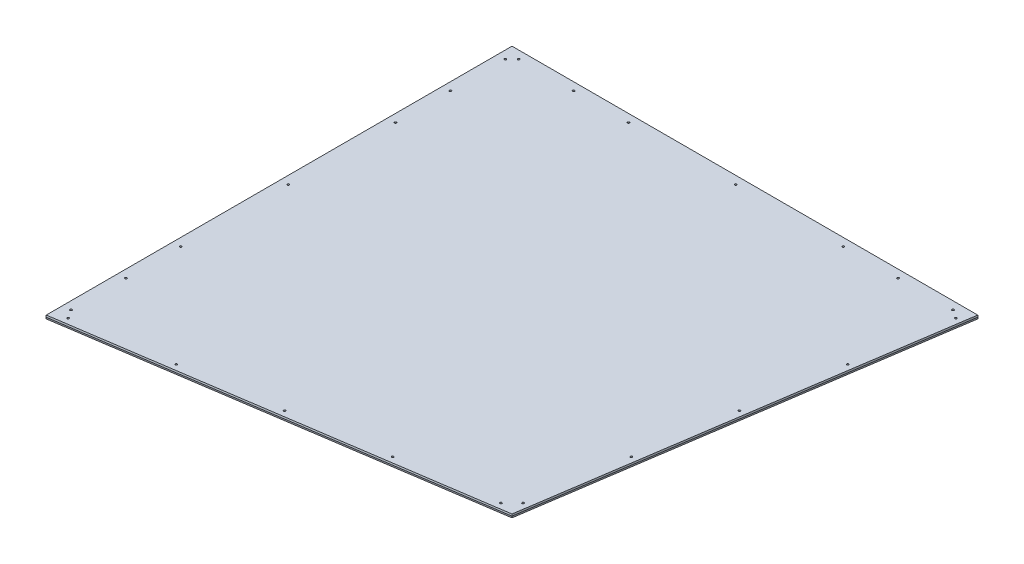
ISO-10303-21;
HEADER;
FILE_DESCRIPTION(('STEP AP214'),'2;1');
FILE_NAME('part.step','',(''),(''),'','','');
FILE_SCHEMA(('AUTOMOTIVE_DESIGN { 1 0 10303 214 1 1 1 1 }'));
ENDSEC;
DATA;
#1=APPLICATION_CONTEXT('core data for automotive mechanical design processes');
#2=APPLICATION_PROTOCOL_DEFINITION('international standard','automotive_design',2000,#1);
#3=PRODUCT_CONTEXT('',#1,'mechanical');
#4=PRODUCT('Part','Part','',(#3));
#5=PRODUCT_RELATED_PRODUCT_CATEGORY('part','',(#4));
#6=PRODUCT_DEFINITION_FORMATION('','',#4);
#7=PRODUCT_DEFINITION_CONTEXT('part definition',#1,'design');
#8=PRODUCT_DEFINITION('design','',#6,#7);
#9=PRODUCT_DEFINITION_SHAPE('','',#8);
#10=(LENGTH_UNIT() NAMED_UNIT(*) SI_UNIT(.MILLI.,.METRE.));
#11=(NAMED_UNIT(*) PLANE_ANGLE_UNIT() SI_UNIT($,.RADIAN.));
#12=(NAMED_UNIT(*) SI_UNIT($,.STERADIAN.) SOLID_ANGLE_UNIT());
#13=UNCERTAINTY_MEASURE_WITH_UNIT(LENGTH_MEASURE(1.E-05),#10,'distance_accuracy_value','');
#14=(GEOMETRIC_REPRESENTATION_CONTEXT(3) GLOBAL_UNCERTAINTY_ASSIGNED_CONTEXT((#13)) GLOBAL_UNIT_ASSIGNED_CONTEXT((#10,
#11,#12)) REPRESENTATION_CONTEXT('',''));
#15=CARTESIAN_POINT('',(0.,0.,0.));
#16=DIRECTION('',(0.,0.,1.));
#17=DIRECTION('',(1.,0.,0.));
#18=AXIS2_PLACEMENT_3D('',#15,#16,#17);
#19=CARTESIAN_POINT('',(0.,4.365625,0.));
#20=DIRECTION('',(0.,0.,1.));
#21=DIRECTION('',(1.,0.,0.));
#22=AXIS2_PLACEMENT_3D('',#19,#20,#21);
#23=PLANE('',#22);
#24=DIRECTION('',(-0.147902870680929,0.989001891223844,0.));
#25=VECTOR('',#24,1.);
#26=CARTESIAN_POINT('',(1212.85,2.18027885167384E-13,-3.78712686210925E-12));
#27=LINE('',#26,#25);
#28=CARTESIAN_POINT('',(1212.85,2.18027885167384E-13,-3.78712686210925E-12));
#29=VERTEX_POINT('',#28);
#30=CARTESIAN_POINT('',(1212.19713120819,4.36562500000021,-3.78330999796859E-12));
#31=VERTEX_POINT('',#30);
#32=EDGE_CURVE('E92',#29,#31,#27,.T.);
#33=ORIENTED_EDGE('',*,*,#32,.F.);
#34=DIRECTION('',(0.147902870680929,0.989001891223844,0.));
#35=VECTOR('',#34,1.);
#36=CARTESIAN_POINT('',(1212.85,2.18027885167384E-13,-3.78712686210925E-12));
#37=LINE('',#36,#35);
#38=CARTESIAN_POINT('',(1212.19713120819,-4.36562499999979,-3.78686655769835E-12));
#39=VERTEX_POINT('',#38);
#40=EDGE_CURVE('E98',#39,#29,#37,.T.);
#41=ORIENTED_EDGE('',*,*,#40,.F.);
#42=DIRECTION('',(-1.,0.,0.));
#43=VECTOR('',#42,1.);
#44=CARTESIAN_POINT('',(0.,-4.365625,0.));
#45=LINE('',#44,#43);
#46=CARTESIAN_POINT('',(0.,-4.365625,0.));
#47=VERTEX_POINT('',#46);
#48=EDGE_CURVE('E118',#39,#47,#45,.T.);
#49=ORIENTED_EDGE('',*,*,#48,.T.);
#50=DIRECTION('',(0.,-1.,0.));
#51=VECTOR('',#50,1.);
#52=CARTESIAN_POINT('',(0.,4.365625,0.));
#53=LINE('',#52,#51);
#54=CARTESIAN_POINT('',(0.,4.365625,0.));
#55=VERTEX_POINT('',#54);
#56=EDGE_CURVE('E123',#55,#47,#53,.T.);
#57=ORIENTED_EDGE('',*,*,#56,.F.);
#58=DIRECTION('',(-1.,0.,0.));
#59=VECTOR('',#58,1.);
#60=CARTESIAN_POINT('',(0.,4.365625,0.));
#61=LINE('',#60,#59);
#62=EDGE_CURVE('E60',#31,#55,#61,.T.);
#63=ORIENTED_EDGE('',*,*,#62,.F.);
#64=EDGE_LOOP('',(#33,#41,#49,#57,#63));
#65=FACE_BOUND('',#64,.T.);
#66=ADVANCED_FACE('F37',(#65),#23,.F.);
#67=CARTESIAN_POINT('',(0.,4.365625,0.));
#68=DIRECTION('',(1.,0.,0.));
#69=DIRECTION('',(0.,0.,-1.));
#70=AXIS2_PLACEMENT_3D('',#67,#68,#69);
#71=PLANE('',#70);
#72=DIRECTION('',(0.,0.,1.));
#73=VECTOR('',#72,1.);
#74=CARTESIAN_POINT('',(0.,-4.365625,0.));
#75=LINE('',#74,#73);
#76=CARTESIAN_POINT('',(-3.78586681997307E-12,-4.3656249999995,1212.19713120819));
#77=VERTEX_POINT('',#76);
#78=EDGE_CURVE('E121',#47,#77,#75,.T.);
#79=ORIENTED_EDGE('',*,*,#78,.T.);
#80=DIRECTION('',(0.,-0.989001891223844,-0.147902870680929));
#81=VECTOR('',#80,1.);
#82=CARTESIAN_POINT('',(-3.78712686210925E-12,4.94038478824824E-13,1212.85));
#83=LINE('',#82,#81);
#84=CARTESIAN_POINT('',(-3.78712686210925E-12,4.94038478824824E-13,1212.85));
#85=VERTEX_POINT('',#84);
#86=EDGE_CURVE('E51',#85,#77,#83,.T.);
#87=ORIENTED_EDGE('',*,*,#86,.F.);
#88=DIRECTION('',(0.,-0.989001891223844,0.147902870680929));
#89=VECTOR('',#88,1.);
#90=CARTESIAN_POINT('',(-3.78712686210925E-12,4.94038478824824E-13,1212.85));
#91=LINE('',#90,#89);
#92=CARTESIAN_POINT('',(-3.78430973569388E-12,4.36562500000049,1212.19713120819));
#93=VERTEX_POINT('',#92);
#94=EDGE_CURVE('E113',#93,#85,#91,.T.);
#95=ORIENTED_EDGE('',*,*,#94,.F.);
#96=DIRECTION('',(0.,0.,1.));
#97=VECTOR('',#96,1.);
#98=CARTESIAN_POINT('',(0.,4.365625,0.));
#99=LINE('',#98,#97);
#100=EDGE_CURVE('E120',#55,#93,#99,.T.);
#101=ORIENTED_EDGE('',*,*,#100,.F.);
#102=ORIENTED_EDGE('',*,*,#56,.T.);
#103=EDGE_LOOP('',(#79,#87,#95,#101,#102));
#104=FACE_BOUND('',#103,.T.);
#105=ADVANCED_FACE('F139',(#104),#71,.F.);
#106=CARTESIAN_POINT('',(0.,4.365625,0.));
#107=DIRECTION('',(0.,-1.,0.));
#108=DIRECTION('',(0.,0.,-1.));
#109=AXIS2_PLACEMENT_3D('',#106,#107,#108);
#110=PLANE('',#109);
#111=CARTESIAN_POINT('',(20.6247999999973,4.36562500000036,882.65));
#112=DIRECTION('',(0.,-1.,0.));
#113=DIRECTION('',(0.,0.,-1.));
#114=AXIS2_PLACEMENT_3D('',#111,#112,#113);
#115=CIRCLE('',#114,2.57936999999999);
#116=CARTESIAN_POINT('',(20.6247999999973,4.36562500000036,880.07063));
#117=VERTEX_POINT('',#116);
#118=EDGE_CURVE('E387',#117,#117,#115,.T.);
#119=ORIENTED_EDGE('',*,*,#118,.T.);
#120=EDGE_LOOP('',(#119));
#121=FACE_BOUND('',#120,.T.);
#122=CARTESIAN_POINT('',(20.624799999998,4.36562500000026,603.25));
#123=DIRECTION('',(0.,-1.,0.));
#124=DIRECTION('',(0.,0.,-1.));
#125=AXIS2_PLACEMENT_3D('',#122,#123,#124);
#126=CIRCLE('',#125,2.57936999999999);
#127=CARTESIAN_POINT('',(20.624799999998,4.36562500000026,600.67063));
#128=VERTEX_POINT('',#127);
#129=EDGE_CURVE('E394',#128,#128,#126,.T.);
#130=ORIENTED_EDGE('',*,*,#129,.T.);
#131=EDGE_LOOP('',(#130));
#132=FACE_BOUND('',#131,.T.);
#133=CARTESIAN_POINT('',(20.6247999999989,4.36562500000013,323.85));
#134=DIRECTION('',(0.,-1.,0.));
#135=DIRECTION('',(0.,0.,-1.));
#136=AXIS2_PLACEMENT_3D('',#133,#134,#135);
#137=CIRCLE('',#136,2.57937000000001);
#138=CARTESIAN_POINT('',(20.6247999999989,4.36562500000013,321.27063));
#139=VERTEX_POINT('',#138);
#140=EDGE_CURVE('E400',#139,#139,#137,.T.);
#141=ORIENTED_EDGE('',*,*,#140,.T.);
#142=EDGE_LOOP('',(#141));
#143=FACE_BOUND('',#142,.T.);
#144=CARTESIAN_POINT('',(20.6247999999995,4.36562500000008,180.975));
#145=DIRECTION('',(0.,-1.,0.));
#146=DIRECTION('',(0.,0.,-1.));
#147=AXIS2_PLACEMENT_3D('',#144,#145,#146);
#148=CIRCLE('',#147,2.57937);
#149=CARTESIAN_POINT('',(20.6247999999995,4.36562500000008,178.39563));
#150=VERTEX_POINT('',#149);
#151=EDGE_CURVE('E406',#150,#150,#148,.T.);
#152=ORIENTED_EDGE('',*,*,#151,.T.);
#153=EDGE_LOOP('',(#152));
#154=FACE_BOUND('',#153,.T.);
#155=CARTESIAN_POINT('',(20.6247999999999,4.36562500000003,38.1));
#156=DIRECTION('',(0.,-1.,0.));
#157=DIRECTION('',(0.,0.,-1.));
#158=AXIS2_PLACEMENT_3D('',#155,#156,#157);
#159=CIRCLE('',#158,2.57937);
#160=CARTESIAN_POINT('',(20.6247999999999,4.36562500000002,35.52063));
#161=VERTEX_POINT('',#160);
#162=EDGE_CURVE('E412',#161,#161,#159,.T.);
#163=ORIENTED_EDGE('',*,*,#162,.T.);
#164=EDGE_LOOP('',(#163));
#165=FACE_BOUND('',#164,.T.);
#166=CARTESIAN_POINT('',(38.1,4.365625,20.6247999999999));
#167=DIRECTION('',(0.,-1.,0.));
#168=DIRECTION('',(0.,0.,-1.));
#169=AXIS2_PLACEMENT_3D('',#166,#167,#168);
#170=CIRCLE('',#169,2.57937);
#171=CARTESIAN_POINT('',(38.1,4.365625,18.0454299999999));
#172=VERTEX_POINT('',#171);
#173=EDGE_CURVE('E418',#172,#172,#170,.T.);
#174=ORIENTED_EDGE('',*,*,#173,.T.);
#175=EDGE_LOOP('',(#174));
#176=FACE_BOUND('',#175,.T.);
#177=CARTESIAN_POINT('',(180.975,4.36562500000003,20.6247999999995));
#178=DIRECTION('',(0.,-1.,0.));
#179=DIRECTION('',(0.,0.,-1.));
#180=AXIS2_PLACEMENT_3D('',#177,#178,#179);
#181=CIRCLE('',#180,2.57936999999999);
#182=CARTESIAN_POINT('',(180.975,4.36562500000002,18.0454299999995));
#183=VERTEX_POINT('',#182);
#184=EDGE_CURVE('E424',#183,#183,#181,.T.);
#185=ORIENTED_EDGE('',*,*,#184,.T.);
#186=EDGE_LOOP('',(#185));
#187=FACE_BOUND('',#186,.T.);
#188=CARTESIAN_POINT('',(323.85,4.36562500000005,20.624799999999));
#189=DIRECTION('',(0.,-1.,0.));
#190=DIRECTION('',(0.,0.,-1.));
#191=AXIS2_PLACEMENT_3D('',#188,#189,#190);
#192=CIRCLE('',#191,2.57937000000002);
#193=CARTESIAN_POINT('',(323.85,4.36562500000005,18.0454299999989));
#194=VERTEX_POINT('',#193);
#195=EDGE_CURVE('E430',#194,#194,#192,.T.);
#196=ORIENTED_EDGE('',*,*,#195,.T.);
#197=EDGE_LOOP('',(#196));
#198=FACE_BOUND('',#197,.T.);
#199=CARTESIAN_POINT('',(603.25,4.36562500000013,20.6247999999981));
#200=DIRECTION('',(0.,-1.,0.));
#201=DIRECTION('',(0.,0.,-1.));
#202=AXIS2_PLACEMENT_3D('',#199,#200,#201);
#203=CIRCLE('',#202,2.57936999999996);
#204=CARTESIAN_POINT('',(603.25,4.36562500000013,18.0454299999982));
#205=VERTEX_POINT('',#204);
#206=EDGE_CURVE('E436',#205,#205,#203,.T.);
#207=ORIENTED_EDGE('',*,*,#206,.T.);
#208=EDGE_LOOP('',(#207));
#209=FACE_BOUND('',#208,.T.);
#210=CARTESIAN_POINT('',(882.65,4.36562500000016,20.6247999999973));
#211=DIRECTION('',(0.,-1.,0.));
#212=DIRECTION('',(0.,0.,-1.));
#213=AXIS2_PLACEMENT_3D('',#210,#211,#212);
#214=CIRCLE('',#213,2.57936999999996);
#215=CARTESIAN_POINT('',(882.65,4.36562500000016,18.0454299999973));
#216=VERTEX_POINT('',#215);
#217=EDGE_CURVE('E442',#216,#216,#214,.T.);
#218=ORIENTED_EDGE('',*,*,#217,.T.);
#219=EDGE_LOOP('',(#218));
#220=FACE_BOUND('',#219,.T.);
#221=CARTESIAN_POINT('',(1025.525,4.36562500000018,20.6247999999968));
#222=DIRECTION('',(0.,-1.,0.));
#223=DIRECTION('',(0.,0.,-1.));
#224=AXIS2_PLACEMENT_3D('',#221,#222,#223);
#225=CIRCLE('',#224,2.57937000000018);
#226=CARTESIAN_POINT('',(1025.525,4.36562500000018,18.0454299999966));
#227=VERTEX_POINT('',#226);
#228=EDGE_CURVE('E448',#227,#227,#225,.T.);
#229=ORIENTED_EDGE('',*,*,#228,.T.);
#230=EDGE_LOOP('',(#229));
#231=FACE_BOUND('',#230,.T.);
#232=CARTESIAN_POINT('',(1190.75856510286,4.36562500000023,35.6765466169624));
#233=DIRECTION('',(0.,-1.,0.));
#234=DIRECTION('',(0.,0.,-1.));
#235=AXIS2_PLACEMENT_3D('',#232,#233,#234);
#236=CIRCLE('',#235,2.5793700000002);
#237=CARTESIAN_POINT('',(1190.75856510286,4.36562500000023,33.0971766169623));
#238=VERTEX_POINT('',#237);
#239=EDGE_CURVE('E454',#238,#238,#236,.T.);
#240=ORIENTED_EDGE('',*,*,#239,.T.);
#241=EDGE_LOOP('',(#240));
#242=FACE_BOUND('',#241,.T.);
#243=CARTESIAN_POINT('',(1168.4,4.36562500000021,20.6247999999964));
#244=DIRECTION('',(0.,-1.,0.));
#245=DIRECTION('',(0.,0.,-1.));
#246=AXIS2_PLACEMENT_3D('',#243,#244,#245);
#247=CIRCLE('',#246,2.57937000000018);
#248=CARTESIAN_POINT('',(1168.4,4.36562500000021,18.0454299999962));
#249=VERTEX_POINT('',#248);
#250=EDGE_CURVE('E460',#249,#249,#247,.T.);
#251=ORIENTED_EDGE('',*,*,#250,.T.);
#252=EDGE_LOOP('',(#251));
#253=FACE_BOUND('',#252,.T.);
#254=CARTESIAN_POINT('',(1154.13041917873,4.36562500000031,280.602864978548));
#255=DIRECTION('',(0.,-1.,0.));
#256=DIRECTION('',(0.,0.,-1.));
#257=AXIS2_PLACEMENT_3D('',#254,#255,#256);
#258=CIRCLE('',#257,2.5793700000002);
#259=CARTESIAN_POINT('',(1154.13041917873,4.36562500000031,278.023494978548));
#260=VERTEX_POINT('',#259);
#261=EDGE_CURVE('E466',#260,#260,#258,.T.);
#262=ORIENTED_EDGE('',*,*,#261,.T.);
#263=EDGE_LOOP('',(#262));
#264=FACE_BOUND('',#263,.T.);
#265=CARTESIAN_POINT('',(1117.5022732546,4.36562500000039,525.529183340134));
#266=DIRECTION('',(0.,-1.,0.));
#267=DIRECTION('',(0.,0.,-1.));
#268=AXIS2_PLACEMENT_3D('',#265,#266,#267);
#269=CIRCLE('',#268,2.5793700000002);
#270=CARTESIAN_POINT('',(1117.5022732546,4.36562500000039,522.949813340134));
#271=VERTEX_POINT('',#270);
#272=EDGE_CURVE('E472',#271,#271,#269,.T.);
#273=ORIENTED_EDGE('',*,*,#272,.T.);
#274=EDGE_LOOP('',(#273));
#275=FACE_BOUND('',#274,.T.);
#276=CARTESIAN_POINT('',(1080.87412733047,4.36562500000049,770.45550170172));
#277=DIRECTION('',(0.,-1.,0.));
#278=DIRECTION('',(0.,0.,-1.));
#279=AXIS2_PLACEMENT_3D('',#276,#277,#278);
#280=CIRCLE('',#279,2.5793700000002);
#281=CARTESIAN_POINT('',(1080.87412733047,4.36562500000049,767.876131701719));
#282=VERTEX_POINT('',#281);
#283=EDGE_CURVE('E478',#282,#282,#280,.T.);
#284=ORIENTED_EDGE('',*,*,#283,.T.);
#285=EDGE_LOOP('',(#284));
#286=FACE_BOUND('',#285,.T.);
#287=CARTESIAN_POINT('',(1044.24598140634,4.3656250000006,1015.38182006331));
#288=DIRECTION('',(0.,-1.,0.));
#289=DIRECTION('',(0.,0.,-1.));
#290=AXIS2_PLACEMENT_3D('',#287,#288,#289);
#291=CIRCLE('',#290,2.5793700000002);
#292=CARTESIAN_POINT('',(1044.24598140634,4.3656250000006,1012.80245006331));
#293=VERTEX_POINT('',#292);
#294=EDGE_CURVE('E484',#293,#293,#291,.T.);
#295=ORIENTED_EDGE('',*,*,#294,.T.);
#296=EDGE_LOOP('',(#295));
#297=FACE_BOUND('',#296,.T.);
#298=CARTESIAN_POINT('',(1015.38182006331,4.36562500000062,1044.24598140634));
#299=DIRECTION('',(0.,-1.,0.));
#300=DIRECTION('',(0.,0.,-1.));
#301=AXIS2_PLACEMENT_3D('',#298,#299,#300);
#302=CIRCLE('',#301,2.5793700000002);
#303=CARTESIAN_POINT('',(1015.38182006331,4.36562500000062,1041.66661140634));
#304=VERTEX_POINT('',#303);
#305=EDGE_CURVE('E490',#304,#304,#302,.T.);
#306=ORIENTED_EDGE('',*,*,#305,.T.);
#307=EDGE_LOOP('',(#306));
#308=FACE_BOUND('',#307,.T.);
#309=CARTESIAN_POINT('',(770.455501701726,4.3656250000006,1080.87412733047));
#310=DIRECTION('',(0.,-1.,0.));
#311=DIRECTION('',(0.,0.,-1.));
#312=AXIS2_PLACEMENT_3D('',#309,#310,#311);
#313=CIRCLE('',#312,2.57936999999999);
#314=CARTESIAN_POINT('',(770.455501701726,4.3656250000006,1078.29475733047));
#315=VERTEX_POINT('',#314);
#316=EDGE_CURVE('E496',#315,#315,#313,.T.);
#317=ORIENTED_EDGE('',*,*,#316,.T.);
#318=EDGE_LOOP('',(#317));
#319=FACE_BOUND('',#318,.T.);
#320=CARTESIAN_POINT('',(525.529183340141,4.36562500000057,1117.5022732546));
#321=DIRECTION('',(0.,-1.,0.));
#322=DIRECTION('',(0.,0.,-1.));
#323=AXIS2_PLACEMENT_3D('',#320,#321,#322);
#324=CIRCLE('',#323,2.57936999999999);
#325=CARTESIAN_POINT('',(525.529183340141,4.36562500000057,1114.9229032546));
#326=VERTEX_POINT('',#325);
#327=EDGE_CURVE('E502',#326,#326,#324,.T.);
#328=ORIENTED_EDGE('',*,*,#327,.T.);
#329=EDGE_LOOP('',(#328));
#330=FACE_BOUND('',#329,.T.);
#331=CARTESIAN_POINT('',(280.602864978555,4.36562500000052,1154.13041917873));
#332=DIRECTION('',(0.,-1.,0.));
#333=DIRECTION('',(0.,0.,-1.));
#334=AXIS2_PLACEMENT_3D('',#331,#332,#333);
#335=CIRCLE('',#334,2.57937000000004);
#336=CARTESIAN_POINT('',(280.602864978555,4.36562500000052,1151.55104917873));
#337=VERTEX_POINT('',#336);
#338=EDGE_CURVE('E508',#337,#337,#335,.T.);
#339=ORIENTED_EDGE('',*,*,#338,.T.);
#340=EDGE_LOOP('',(#339));
#341=FACE_BOUND('',#340,.T.);
#342=CARTESIAN_POINT('',(20.6247999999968,4.36562500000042,1025.525));
#343=DIRECTION('',(0.,-1.,0.));
#344=DIRECTION('',(0.,0.,-1.));
#345=AXIS2_PLACEMENT_3D('',#342,#343,#344);
#346=CIRCLE('',#345,2.57937000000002);
#347=CARTESIAN_POINT('',(20.6247999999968,4.36562500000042,1022.94563));
#348=VERTEX_POINT('',#347);
#349=EDGE_CURVE('E514',#348,#348,#346,.T.);
#350=ORIENTED_EDGE('',*,*,#349,.T.);
#351=EDGE_LOOP('',(#350));
#352=FACE_BOUND('',#351,.T.);
#353=CARTESIAN_POINT('',(20.6247999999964,4.36562500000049,1168.4));
#354=DIRECTION('',(0.,-1.,0.));
#355=DIRECTION('',(0.,0.,-1.));
#356=AXIS2_PLACEMENT_3D('',#353,#354,#355);
#357=CIRCLE('',#356,2.57937000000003);
#358=CARTESIAN_POINT('',(20.6247999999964,4.36562500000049,1165.82063));
#359=VERTEX_POINT('',#358);
#360=EDGE_CURVE('E520',#359,#359,#357,.T.);
#361=ORIENTED_EDGE('',*,*,#360,.T.);
#362=EDGE_LOOP('',(#361));
#363=FACE_BOUND('',#362,.T.);
#364=CARTESIAN_POINT('',(35.6765466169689,4.36562500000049,1190.75856510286));
#365=DIRECTION('',(0.,-1.,0.));
#366=DIRECTION('',(0.,0.,-1.));
#367=AXIS2_PLACEMENT_3D('',#364,#365,#366);
#368=CIRCLE('',#367,2.57937000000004);
#369=CARTESIAN_POINT('',(35.6765466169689,4.36562500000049,1188.17919510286));
#370=VERTEX_POINT('',#369);
#371=EDGE_CURVE('E104',#370,#370,#368,.T.);
#372=ORIENTED_EDGE('',*,*,#371,.T.);
#373=EDGE_LOOP('',(#372));
#374=FACE_BOUND('',#373,.T.);
#375=DIRECTION('',(0.989001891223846,0.,-0.147902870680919));
#376=VECTOR('',#375,1.);
#377=CARTESIAN_POINT('',(177.315612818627,4.36562500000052,1185.68000481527));
#378=LINE('',#377,#376);
#379=CARTESIAN_POINT('',(1054.49928214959,4.36562500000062,1054.49928214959));
#380=VERTEX_POINT('',#379);
#381=EDGE_CURVE('E131',#93,#380,#378,.T.);
#382=ORIENTED_EDGE('',*,*,#381,.T.);
#383=DIRECTION('',(0.147902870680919,0.,-0.989001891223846));
#384=VECTOR('',#383,1.);
#385=CARTESIAN_POINT('',(1008.19904798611,4.36562500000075,1364.10124552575));
#386=LINE('',#385,#384);
#387=EDGE_CURVE('E95',#380,#31,#386,.T.);
#388=ORIENTED_EDGE('',*,*,#387,.T.);
#389=ORIENTED_EDGE('',*,*,#62,.T.);
#390=ORIENTED_EDGE('',*,*,#100,.T.);
#391=EDGE_LOOP('',(#382,#388,#389,#390));
#392=FACE_BOUND('',#391,.T.);
#393=ADVANCED_FACE('F144',(#121,#132,#143,#154,#165,#176,#187,#198,#209,#220,#231,#242,#253,
#264,#275,#286,#297,#308,#319,#330,#341,#352,#363,#374,#392),#110,.F.);
#394=CARTESIAN_POINT('',(0.,-4.365625,0.));
#395=DIRECTION('',(0.,-1.,0.));
#396=DIRECTION('',(0.,0.,-1.));
#397=AXIS2_PLACEMENT_3D('',#394,#395,#396);
#398=PLANE('',#397);
#399=CARTESIAN_POINT('',(20.6247999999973,-4.36562499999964,882.65));
#400=DIRECTION('',(0.,-1.,0.));
#401=DIRECTION('',(0.,0.,-1.));
#402=AXIS2_PLACEMENT_3D('',#399,#400,#401);
#403=CIRCLE('',#402,2.57936999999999);
#404=CARTESIAN_POINT('',(20.6247999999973,-4.36562499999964,880.07063));
#405=VERTEX_POINT('',#404);
#406=EDGE_CURVE('E389',#405,#405,#403,.T.);
#407=ORIENTED_EDGE('',*,*,#406,.F.);
#408=EDGE_LOOP('',(#407));
#409=FACE_BOUND('',#408,.T.);
#410=CARTESIAN_POINT('',(20.6247999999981,-4.36562499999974,603.25));
#411=DIRECTION('',(0.,-1.,0.));
#412=DIRECTION('',(0.,0.,-1.));
#413=AXIS2_PLACEMENT_3D('',#410,#411,#412);
#414=CIRCLE('',#413,2.57936999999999);
#415=CARTESIAN_POINT('',(20.6247999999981,-4.36562499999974,600.67063));
#416=VERTEX_POINT('',#415);
#417=EDGE_CURVE('E391',#416,#416,#414,.T.);
#418=ORIENTED_EDGE('',*,*,#417,.F.);
#419=EDGE_LOOP('',(#418));
#420=FACE_BOUND('',#419,.T.);
#421=CARTESIAN_POINT('',(20.624799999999,-4.36562499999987,323.85));
#422=DIRECTION('',(0.,-1.,0.));
#423=DIRECTION('',(0.,0.,-1.));
#424=AXIS2_PLACEMENT_3D('',#421,#422,#423);
#425=CIRCLE('',#424,2.57937000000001);
#426=CARTESIAN_POINT('',(20.624799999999,-4.36562499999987,321.27063));
#427=VERTEX_POINT('',#426);
#428=EDGE_CURVE('E397',#427,#427,#425,.T.);
#429=ORIENTED_EDGE('',*,*,#428,.F.);
#430=EDGE_LOOP('',(#429));
#431=FACE_BOUND('',#430,.T.);
#432=CARTESIAN_POINT('',(20.6247999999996,-4.36562499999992,180.975));
#433=DIRECTION('',(0.,-1.,0.));
#434=DIRECTION('',(0.,0.,-1.));
#435=AXIS2_PLACEMENT_3D('',#432,#433,#434);
#436=CIRCLE('',#435,2.57937);
#437=CARTESIAN_POINT('',(20.6247999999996,-4.36562499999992,178.39563));
#438=VERTEX_POINT('',#437);
#439=EDGE_CURVE('E403',#438,#438,#436,.T.);
#440=ORIENTED_EDGE('',*,*,#439,.F.);
#441=EDGE_LOOP('',(#440));
#442=FACE_BOUND('',#441,.T.);
#443=CARTESIAN_POINT('',(20.6248,-4.36562499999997,38.1));
#444=DIRECTION('',(0.,-1.,0.));
#445=DIRECTION('',(0.,0.,-1.));
#446=AXIS2_PLACEMENT_3D('',#443,#444,#445);
#447=CIRCLE('',#446,2.57937);
#448=CARTESIAN_POINT('',(20.6248,-4.36562499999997,35.52063));
#449=VERTEX_POINT('',#448);
#450=EDGE_CURVE('E409',#449,#449,#447,.T.);
#451=ORIENTED_EDGE('',*,*,#450,.F.);
#452=EDGE_LOOP('',(#451));
#453=FACE_BOUND('',#452,.T.);
#454=CARTESIAN_POINT('',(38.1,-4.365625,20.6247999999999));
#455=DIRECTION('',(0.,-1.,0.));
#456=DIRECTION('',(0.,0.,-1.));
#457=AXIS2_PLACEMENT_3D('',#454,#455,#456);
#458=CIRCLE('',#457,2.57937);
#459=CARTESIAN_POINT('',(38.1,-4.365625,18.0454299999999));
#460=VERTEX_POINT('',#459);
#461=EDGE_CURVE('E415',#460,#460,#458,.T.);
#462=ORIENTED_EDGE('',*,*,#461,.F.);
#463=EDGE_LOOP('',(#462));
#464=FACE_BOUND('',#463,.T.);
#465=CARTESIAN_POINT('',(180.975,-4.36562499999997,20.6247999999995));
#466=DIRECTION('',(0.,-1.,0.));
#467=DIRECTION('',(0.,0.,-1.));
#468=AXIS2_PLACEMENT_3D('',#465,#466,#467);
#469=CIRCLE('',#468,2.57936999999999);
#470=CARTESIAN_POINT('',(180.975,-4.36562499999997,18.0454299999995));
#471=VERTEX_POINT('',#470);
#472=EDGE_CURVE('E421',#471,#471,#469,.T.);
#473=ORIENTED_EDGE('',*,*,#472,.F.);
#474=EDGE_LOOP('',(#473));
#475=FACE_BOUND('',#474,.T.);
#476=CARTESIAN_POINT('',(323.85,-4.36562499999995,20.624799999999));
#477=DIRECTION('',(0.,-1.,0.));
#478=DIRECTION('',(0.,0.,-1.));
#479=AXIS2_PLACEMENT_3D('',#476,#477,#478);
#480=CIRCLE('',#479,2.57937000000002);
#481=CARTESIAN_POINT('',(323.85,-4.36562499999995,18.0454299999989));
#482=VERTEX_POINT('',#481);
#483=EDGE_CURVE('E427',#482,#482,#480,.T.);
#484=ORIENTED_EDGE('',*,*,#483,.F.);
#485=EDGE_LOOP('',(#484));
#486=FACE_BOUND('',#485,.T.);
#487=CARTESIAN_POINT('',(603.25,-4.36562499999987,20.6247999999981));
#488=DIRECTION('',(0.,-1.,0.));
#489=DIRECTION('',(0.,0.,-1.));
#490=AXIS2_PLACEMENT_3D('',#487,#488,#489);
#491=CIRCLE('',#490,2.57936999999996);
#492=CARTESIAN_POINT('',(603.25,-4.36562499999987,18.0454299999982));
#493=VERTEX_POINT('',#492);
#494=EDGE_CURVE('E433',#493,#493,#491,.T.);
#495=ORIENTED_EDGE('',*,*,#494,.F.);
#496=EDGE_LOOP('',(#495));
#497=FACE_BOUND('',#496,.T.);
#498=CARTESIAN_POINT('',(882.65,-4.36562499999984,20.6247999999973));
#499=DIRECTION('',(0.,-1.,0.));
#500=DIRECTION('',(0.,0.,-1.));
#501=AXIS2_PLACEMENT_3D('',#498,#499,#500);
#502=CIRCLE('',#501,2.57936999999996);
#503=CARTESIAN_POINT('',(882.65,-4.36562499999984,18.0454299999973));
#504=VERTEX_POINT('',#503);
#505=EDGE_CURVE('E439',#504,#504,#502,.T.);
#506=ORIENTED_EDGE('',*,*,#505,.F.);
#507=EDGE_LOOP('',(#506));
#508=FACE_BOUND('',#507,.T.);
#509=CARTESIAN_POINT('',(1025.525,-4.36562499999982,20.6247999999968));
#510=DIRECTION('',(0.,-1.,0.));
#511=DIRECTION('',(0.,0.,-1.));
#512=AXIS2_PLACEMENT_3D('',#509,#510,#511);
#513=CIRCLE('',#512,2.57937000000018);
#514=CARTESIAN_POINT('',(1025.525,-4.36562499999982,18.0454299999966));
#515=VERTEX_POINT('',#514);
#516=EDGE_CURVE('E445',#515,#515,#513,.T.);
#517=ORIENTED_EDGE('',*,*,#516,.F.);
#518=EDGE_LOOP('',(#517));
#519=FACE_BOUND('',#518,.T.);
#520=CARTESIAN_POINT('',(1190.75856510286,-4.36562499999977,35.6765466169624));
#521=DIRECTION('',(0.,-1.,0.));
#522=DIRECTION('',(0.,0.,-1.));
#523=AXIS2_PLACEMENT_3D('',#520,#521,#522);
#524=CIRCLE('',#523,2.5793700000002);
#525=CARTESIAN_POINT('',(1190.75856510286,-4.36562499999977,33.0971766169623));
#526=VERTEX_POINT('',#525);
#527=EDGE_CURVE('E451',#526,#526,#524,.T.);
#528=ORIENTED_EDGE('',*,*,#527,.F.);
#529=EDGE_LOOP('',(#528));
#530=FACE_BOUND('',#529,.T.);
#531=CARTESIAN_POINT('',(1168.4,-4.36562499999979,20.6247999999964));
#532=DIRECTION('',(0.,-1.,0.));
#533=DIRECTION('',(0.,0.,-1.));
#534=AXIS2_PLACEMENT_3D('',#531,#532,#533);
#535=CIRCLE('',#534,2.57937000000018);
#536=CARTESIAN_POINT('',(1168.4,-4.36562499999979,18.0454299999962));
#537=VERTEX_POINT('',#536);
#538=EDGE_CURVE('E457',#537,#537,#535,.T.);
#539=ORIENTED_EDGE('',*,*,#538,.F.);
#540=EDGE_LOOP('',(#539));
#541=FACE_BOUND('',#540,.T.);
#542=CARTESIAN_POINT('',(1154.13041917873,-4.36562499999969,280.602864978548));
#543=DIRECTION('',(0.,-1.,0.));
#544=DIRECTION('',(0.,0.,-1.));
#545=AXIS2_PLACEMENT_3D('',#542,#543,#544);
#546=CIRCLE('',#545,2.5793700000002);
#547=CARTESIAN_POINT('',(1154.13041917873,-4.36562499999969,278.023494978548));
#548=VERTEX_POINT('',#547);
#549=EDGE_CURVE('E463',#548,#548,#546,.T.);
#550=ORIENTED_EDGE('',*,*,#549,.F.);
#551=EDGE_LOOP('',(#550));
#552=FACE_BOUND('',#551,.T.);
#553=CARTESIAN_POINT('',(1117.5022732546,-4.36562499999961,525.529183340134));
#554=DIRECTION('',(0.,-1.,0.));
#555=DIRECTION('',(0.,0.,-1.));
#556=AXIS2_PLACEMENT_3D('',#553,#554,#555);
#557=CIRCLE('',#556,2.5793700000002);
#558=CARTESIAN_POINT('',(1117.5022732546,-4.36562499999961,522.949813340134));
#559=VERTEX_POINT('',#558);
#560=EDGE_CURVE('E469',#559,#559,#557,.T.);
#561=ORIENTED_EDGE('',*,*,#560,.F.);
#562=EDGE_LOOP('',(#561));
#563=FACE_BOUND('',#562,.T.);
#564=CARTESIAN_POINT('',(1080.87412733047,-4.3656249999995,770.45550170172));
#565=DIRECTION('',(0.,-1.,0.));
#566=DIRECTION('',(0.,0.,-1.));
#567=AXIS2_PLACEMENT_3D('',#564,#565,#566);
#568=CIRCLE('',#567,2.5793700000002);
#569=CARTESIAN_POINT('',(1080.87412733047,-4.36562499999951,767.876131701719));
#570=VERTEX_POINT('',#569);
#571=EDGE_CURVE('E475',#570,#570,#568,.T.);
#572=ORIENTED_EDGE('',*,*,#571,.F.);
#573=EDGE_LOOP('',(#572));
#574=FACE_BOUND('',#573,.T.);
#575=CARTESIAN_POINT('',(1044.24598140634,-4.3656249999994,1015.38182006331));
#576=DIRECTION('',(0.,-1.,0.));
#577=DIRECTION('',(0.,0.,-1.));
#578=AXIS2_PLACEMENT_3D('',#575,#576,#577);
#579=CIRCLE('',#578,2.5793700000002);
#580=CARTESIAN_POINT('',(1044.24598140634,-4.3656249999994,1012.80245006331));
#581=VERTEX_POINT('',#580);
#582=EDGE_CURVE('E481',#581,#581,#579,.T.);
#583=ORIENTED_EDGE('',*,*,#582,.F.);
#584=EDGE_LOOP('',(#583));
#585=FACE_BOUND('',#584,.T.);
#586=CARTESIAN_POINT('',(1015.38182006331,-4.36562499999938,1044.24598140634));
#587=DIRECTION('',(0.,-1.,0.));
#588=DIRECTION('',(0.,0.,-1.));
#589=AXIS2_PLACEMENT_3D('',#586,#587,#588);
#590=CIRCLE('',#589,2.5793700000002);
#591=CARTESIAN_POINT('',(1015.38182006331,-4.36562499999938,1041.66661140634));
#592=VERTEX_POINT('',#591);
#593=EDGE_CURVE('E487',#592,#592,#590,.T.);
#594=ORIENTED_EDGE('',*,*,#593,.F.);
#595=EDGE_LOOP('',(#594));
#596=FACE_BOUND('',#595,.T.);
#597=CARTESIAN_POINT('',(770.455501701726,-4.3656249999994,1080.87412733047));
#598=DIRECTION('',(0.,-1.,0.));
#599=DIRECTION('',(0.,0.,-1.));
#600=AXIS2_PLACEMENT_3D('',#597,#598,#599);
#601=CIRCLE('',#600,2.57936999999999);
#602=CARTESIAN_POINT('',(770.455501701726,-4.3656249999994,1078.29475733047));
#603=VERTEX_POINT('',#602);
#604=EDGE_CURVE('E493',#603,#603,#601,.T.);
#605=ORIENTED_EDGE('',*,*,#604,.F.);
#606=EDGE_LOOP('',(#605));
#607=FACE_BOUND('',#606,.T.);
#608=CARTESIAN_POINT('',(525.529183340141,-4.36562499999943,1117.5022732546));
#609=DIRECTION('',(0.,-1.,0.));
#610=DIRECTION('',(0.,0.,-1.));
#611=AXIS2_PLACEMENT_3D('',#608,#609,#610);
#612=CIRCLE('',#611,2.57936999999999);
#613=CARTESIAN_POINT('',(525.529183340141,-4.36562499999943,1114.9229032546));
#614=VERTEX_POINT('',#613);
#615=EDGE_CURVE('E499',#614,#614,#612,.T.);
#616=ORIENTED_EDGE('',*,*,#615,.F.);
#617=EDGE_LOOP('',(#616));
#618=FACE_BOUND('',#617,.T.);
#619=CARTESIAN_POINT('',(280.602864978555,-4.36562499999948,1154.13041917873));
#620=DIRECTION('',(0.,-1.,0.));
#621=DIRECTION('',(0.,0.,-1.));
#622=AXIS2_PLACEMENT_3D('',#619,#620,#621);
#623=CIRCLE('',#622,2.57937000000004);
#624=CARTESIAN_POINT('',(280.602864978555,-4.36562499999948,1151.55104917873));
#625=VERTEX_POINT('',#624);
#626=EDGE_CURVE('E505',#625,#625,#623,.T.);
#627=ORIENTED_EDGE('',*,*,#626,.F.);
#628=EDGE_LOOP('',(#627));
#629=FACE_BOUND('',#628,.T.);
#630=CARTESIAN_POINT('',(20.6247999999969,-4.36562499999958,1025.525));
#631=DIRECTION('',(0.,-1.,0.));
#632=DIRECTION('',(0.,0.,-1.));
#633=AXIS2_PLACEMENT_3D('',#630,#631,#632);
#634=CIRCLE('',#633,2.57937000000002);
#635=CARTESIAN_POINT('',(20.6247999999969,-4.36562499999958,1022.94563));
#636=VERTEX_POINT('',#635);
#637=EDGE_CURVE('E511',#636,#636,#634,.T.);
#638=ORIENTED_EDGE('',*,*,#637,.F.);
#639=EDGE_LOOP('',(#638));
#640=FACE_BOUND('',#639,.T.);
#641=CARTESIAN_POINT('',(20.6247999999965,-4.3656249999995,1168.4));
#642=DIRECTION('',(0.,-1.,0.));
#643=DIRECTION('',(0.,0.,-1.));
#644=AXIS2_PLACEMENT_3D('',#641,#642,#643);
#645=CIRCLE('',#644,2.57937000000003);
#646=CARTESIAN_POINT('',(20.6247999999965,-4.36562499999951,1165.82063));
#647=VERTEX_POINT('',#646);
#648=EDGE_CURVE('E517',#647,#647,#645,.T.);
#649=ORIENTED_EDGE('',*,*,#648,.F.);
#650=EDGE_LOOP('',(#649));
#651=FACE_BOUND('',#650,.T.);
#652=CARTESIAN_POINT('',(35.6765466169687,-4.3656249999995,1190.75856510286));
#653=DIRECTION('',(0.,-1.,0.));
#654=DIRECTION('',(0.,0.,-1.));
#655=AXIS2_PLACEMENT_3D('',#652,#653,#654);
#656=CIRCLE('',#655,2.57937000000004);
#657=CARTESIAN_POINT('',(35.6765466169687,-4.36562499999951,1188.17919510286));
#658=VERTEX_POINT('',#657);
#659=EDGE_CURVE('E523',#658,#658,#656,.T.);
#660=ORIENTED_EDGE('',*,*,#659,.F.);
#661=EDGE_LOOP('',(#660));
#662=FACE_BOUND('',#661,.T.);
#663=DIRECTION('',(0.147902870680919,0.,-0.989001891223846));
#664=VECTOR('',#663,1.);
#665=CARTESIAN_POINT('',(1008.19904798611,-4.36562499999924,1364.10124552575));
#666=LINE('',#665,#664);
#667=CARTESIAN_POINT('',(1054.49928214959,-4.36562499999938,1054.49928214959));
#668=VERTEX_POINT('',#667);
#669=EDGE_CURVE('E101',#668,#39,#666,.T.);
#670=ORIENTED_EDGE('',*,*,#669,.F.);
#671=DIRECTION('',(0.989001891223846,0.,-0.147902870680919));
#672=VECTOR('',#671,1.);
#673=CARTESIAN_POINT('',(177.315612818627,-4.36562499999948,1185.68000481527));
#674=LINE('',#673,#672);
#675=EDGE_CURVE('E129',#77,#668,#674,.T.);
#676=ORIENTED_EDGE('',*,*,#675,.F.);
#677=ORIENTED_EDGE('',*,*,#78,.F.);
#678=ORIENTED_EDGE('',*,*,#48,.F.);
#679=EDGE_LOOP('',(#670,#676,#677,#678));
#680=FACE_BOUND('',#679,.T.);
#681=ADVANCED_FACE('F142',(#409,#420,#431,#442,#453,#464,#475,#486,#497,#508,#519,#530,#541,
#552,#563,#574,#585,#596,#607,#618,#629,#640,#651,#662,#680),#398,.T.);
#682=CARTESIAN_POINT('',(1364.10124552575,6.54209042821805E-13,1008.85191677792));
#683=DIRECTION('',(-0.146311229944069,-0.146311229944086,-0.978358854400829));
#684=DIRECTION('',(0.,0.989001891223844,-0.147902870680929));
#685=AXIS2_PLACEMENT_3D('',#682,#683,#684);
#686=PLANE('',#685);
#687=DIRECTION('',(-0.989001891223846,0.,0.147902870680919));
#688=VECTOR('',#687,1.);
#689=CARTESIAN_POINT('',(1364.10124552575,6.54209042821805E-13,1008.85191677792));
#690=LINE('',#689,#688);
#691=CARTESIAN_POINT('',(1055.0672175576,6.04044978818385E-13,1055.0672175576));
#692=VERTEX_POINT('',#691);
#693=EDGE_CURVE('E116',#692,#85,#690,.T.);
#694=ORIENTED_EDGE('',*,*,#693,.F.);
#695=DIRECTION('',(-0.127945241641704,0.98349378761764,-0.127945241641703));
#696=VECTOR('',#695,1.);
#697=CARTESIAN_POINT('',(1059.36955614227,-33.071360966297,1059.36955614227));
#698=LINE('',#697,#696);
#699=EDGE_CURVE('E11',#692,#380,#698,.T.);
#700=ORIENTED_EDGE('',*,*,#699,.T.);
#701=ORIENTED_EDGE('',*,*,#381,.F.);
#702=ORIENTED_EDGE('',*,*,#94,.T.);
#703=EDGE_LOOP('',(#694,#700,#701,#702));
#704=FACE_BOUND('',#703,.T.);
#705=ADVANCED_FACE('F136',(#704),#686,.F.);
#706=CARTESIAN_POINT('',(1364.10124552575,6.54209042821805E-13,1008.85191677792));
#707=DIRECTION('',(-0.146311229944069,0.146311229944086,-0.978358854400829));
#708=DIRECTION('',(0.,0.989001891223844,0.147902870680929));
#709=AXIS2_PLACEMENT_3D('',#706,#707,#708);
#710=PLANE('',#709);
#711=ORIENTED_EDGE('',*,*,#675,.T.);
#712=DIRECTION('',(0.127945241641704,0.98349378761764,0.127945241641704));
#713=VECTOR('',#712,1.);
#714=CARTESIAN_POINT('',(1059.36955614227,33.0713609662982,1059.36955614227));
#715=LINE('',#714,#713);
#716=EDGE_CURVE('E44',#668,#692,#715,.T.);
#717=ORIENTED_EDGE('',*,*,#716,.T.);
#718=ORIENTED_EDGE('',*,*,#693,.T.);
#719=ORIENTED_EDGE('',*,*,#86,.T.);
#720=EDGE_LOOP('',(#711,#717,#718,#719));
#721=FACE_BOUND('',#720,.T.);
#722=ADVANCED_FACE('F134',(#721),#710,.F.);
#723=CARTESIAN_POINT('',(1008.85191677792,7.37296643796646E-13,1364.10124552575));
#724=DIRECTION('',(-0.978358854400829,-0.146311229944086,-0.146311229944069));
#725=DIRECTION('',(0.147902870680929,-0.989001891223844,0.));
#726=AXIS2_PLACEMENT_3D('',#723,#724,#725);
#727=PLANE('',#726);
#728=DIRECTION('',(0.147902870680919,0.,-0.989001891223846));
#729=VECTOR('',#728,1.);
#730=CARTESIAN_POINT('',(1008.85191677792,7.37296643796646E-13,1364.10124552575));
#731=LINE('',#730,#729);
#732=EDGE_CURVE('E88',#692,#29,#731,.T.);
#733=ORIENTED_EDGE('',*,*,#732,.T.);
#734=ORIENTED_EDGE('',*,*,#32,.T.);
#735=ORIENTED_EDGE('',*,*,#387,.F.);
#736=ORIENTED_EDGE('',*,*,#699,.F.);
#737=EDGE_LOOP('',(#733,#734,#735,#736));
#738=FACE_BOUND('',#737,.T.);
#739=ADVANCED_FACE('F90',(#738),#727,.F.);
#740=CARTESIAN_POINT('',(1008.85191677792,7.37296643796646E-13,1364.10124552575));
#741=DIRECTION('',(-0.978358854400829,0.146311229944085,-0.146311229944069));
#742=DIRECTION('',(-0.147902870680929,-0.989001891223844,0.));
#743=AXIS2_PLACEMENT_3D('',#740,#741,#742);
#744=PLANE('',#743);
#745=ORIENTED_EDGE('',*,*,#669,.T.);
#746=ORIENTED_EDGE('',*,*,#40,.T.);
#747=ORIENTED_EDGE('',*,*,#732,.F.);
#748=ORIENTED_EDGE('',*,*,#716,.F.);
#749=EDGE_LOOP('',(#745,#746,#747,#748));
#750=FACE_BOUND('',#749,.T.);
#751=ADVANCED_FACE('F99',(#750),#744,.F.);
#752=CARTESIAN_POINT('',(35.6765466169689,4.36562500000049,1190.75856510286));
#753=DIRECTION('',(0.,-1.,0.));
#754=DIRECTION('',(0.,0.,-1.));
#755=AXIS2_PLACEMENT_3D('',#752,#753,#754);
#756=CYLINDRICAL_SURFACE('',#755,2.57937000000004);
#757=ORIENTED_EDGE('',*,*,#371,.F.);
#758=EDGE_LOOP('',(#757));
#759=FACE_BOUND('',#758,.T.);
#760=ORIENTED_EDGE('',*,*,#659,.T.);
#761=EDGE_LOOP('',(#760));
#762=FACE_BOUND('',#761,.T.);
#763=ADVANCED_FACE('F191',(#759,#762),#756,.F.);
#764=CARTESIAN_POINT('',(20.6247999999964,4.36562500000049,1168.4));
#765=DIRECTION('',(0.,-1.,0.));
#766=DIRECTION('',(0.,0.,-1.));
#767=AXIS2_PLACEMENT_3D('',#764,#765,#766);
#768=CYLINDRICAL_SURFACE('',#767,2.57937000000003);
#769=ORIENTED_EDGE('',*,*,#360,.F.);
#770=EDGE_LOOP('',(#769));
#771=FACE_BOUND('',#770,.T.);
#772=ORIENTED_EDGE('',*,*,#648,.T.);
#773=EDGE_LOOP('',(#772));
#774=FACE_BOUND('',#773,.T.);
#775=ADVANCED_FACE('F198',(#771,#774),#768,.F.);
#776=CARTESIAN_POINT('',(20.6247999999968,4.36562500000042,1025.525));
#777=DIRECTION('',(0.,-1.,0.));
#778=DIRECTION('',(0.,0.,-1.));
#779=AXIS2_PLACEMENT_3D('',#776,#777,#778);
#780=CYLINDRICAL_SURFACE('',#779,2.57937000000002);
#781=ORIENTED_EDGE('',*,*,#349,.F.);
#782=EDGE_LOOP('',(#781));
#783=FACE_BOUND('',#782,.T.);
#784=ORIENTED_EDGE('',*,*,#637,.T.);
#785=EDGE_LOOP('',(#784));
#786=FACE_BOUND('',#785,.T.);
#787=ADVANCED_FACE('F206',(#783,#786),#780,.F.);
#788=CARTESIAN_POINT('',(280.602864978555,4.36562500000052,1154.13041917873));
#789=DIRECTION('',(0.,-1.,0.));
#790=DIRECTION('',(0.,0.,-1.));
#791=AXIS2_PLACEMENT_3D('',#788,#789,#790);
#792=CYLINDRICAL_SURFACE('',#791,2.57937000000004);
#793=ORIENTED_EDGE('',*,*,#338,.F.);
#794=EDGE_LOOP('',(#793));
#795=FACE_BOUND('',#794,.T.);
#796=ORIENTED_EDGE('',*,*,#626,.T.);
#797=EDGE_LOOP('',(#796));
#798=FACE_BOUND('',#797,.T.);
#799=ADVANCED_FACE('F214',(#795,#798),#792,.F.);
#800=CARTESIAN_POINT('',(525.529183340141,4.36562500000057,1117.5022732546));
#801=DIRECTION('',(0.,-1.,0.));
#802=DIRECTION('',(0.,0.,-1.));
#803=AXIS2_PLACEMENT_3D('',#800,#801,#802);
#804=CYLINDRICAL_SURFACE('',#803,2.57936999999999);
#805=ORIENTED_EDGE('',*,*,#327,.F.);
#806=EDGE_LOOP('',(#805));
#807=FACE_BOUND('',#806,.T.);
#808=ORIENTED_EDGE('',*,*,#615,.T.);
#809=EDGE_LOOP('',(#808));
#810=FACE_BOUND('',#809,.T.);
#811=ADVANCED_FACE('F222',(#807,#810),#804,.F.);
#812=CARTESIAN_POINT('',(770.455501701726,4.3656250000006,1080.87412733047));
#813=DIRECTION('',(0.,-1.,0.));
#814=DIRECTION('',(0.,0.,-1.));
#815=AXIS2_PLACEMENT_3D('',#812,#813,#814);
#816=CYLINDRICAL_SURFACE('',#815,2.57936999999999);
#817=ORIENTED_EDGE('',*,*,#316,.F.);
#818=EDGE_LOOP('',(#817));
#819=FACE_BOUND('',#818,.T.);
#820=ORIENTED_EDGE('',*,*,#604,.T.);
#821=EDGE_LOOP('',(#820));
#822=FACE_BOUND('',#821,.T.);
#823=ADVANCED_FACE('F230',(#819,#822),#816,.F.);
#824=CARTESIAN_POINT('',(1015.38182006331,4.36562500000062,1044.24598140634));
#825=DIRECTION('',(0.,-1.,0.));
#826=DIRECTION('',(0.,0.,-1.));
#827=AXIS2_PLACEMENT_3D('',#824,#825,#826);
#828=CYLINDRICAL_SURFACE('',#827,2.5793700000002);
#829=ORIENTED_EDGE('',*,*,#305,.F.);
#830=EDGE_LOOP('',(#829));
#831=FACE_BOUND('',#830,.T.);
#832=ORIENTED_EDGE('',*,*,#593,.T.);
#833=EDGE_LOOP('',(#832));
#834=FACE_BOUND('',#833,.T.);
#835=ADVANCED_FACE('F238',(#831,#834),#828,.F.);
#836=CARTESIAN_POINT('',(1044.24598140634,4.3656250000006,1015.38182006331));
#837=DIRECTION('',(0.,-1.,0.));
#838=DIRECTION('',(0.,0.,-1.));
#839=AXIS2_PLACEMENT_3D('',#836,#837,#838);
#840=CYLINDRICAL_SURFACE('',#839,2.5793700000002);
#841=ORIENTED_EDGE('',*,*,#294,.F.);
#842=EDGE_LOOP('',(#841));
#843=FACE_BOUND('',#842,.T.);
#844=ORIENTED_EDGE('',*,*,#582,.T.);
#845=EDGE_LOOP('',(#844));
#846=FACE_BOUND('',#845,.T.);
#847=ADVANCED_FACE('F246',(#843,#846),#840,.F.);
#848=CARTESIAN_POINT('',(1080.87412733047,4.36562500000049,770.45550170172));
#849=DIRECTION('',(0.,-1.,0.));
#850=DIRECTION('',(0.,0.,-1.));
#851=AXIS2_PLACEMENT_3D('',#848,#849,#850);
#852=CYLINDRICAL_SURFACE('',#851,2.5793700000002);
#853=ORIENTED_EDGE('',*,*,#283,.F.);
#854=EDGE_LOOP('',(#853));
#855=FACE_BOUND('',#854,.T.);
#856=ORIENTED_EDGE('',*,*,#571,.T.);
#857=EDGE_LOOP('',(#856));
#858=FACE_BOUND('',#857,.T.);
#859=ADVANCED_FACE('F254',(#855,#858),#852,.F.);
#860=CARTESIAN_POINT('',(1117.5022732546,4.36562500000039,525.529183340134));
#861=DIRECTION('',(0.,-1.,0.));
#862=DIRECTION('',(0.,0.,-1.));
#863=AXIS2_PLACEMENT_3D('',#860,#861,#862);
#864=CYLINDRICAL_SURFACE('',#863,2.5793700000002);
#865=ORIENTED_EDGE('',*,*,#272,.F.);
#866=EDGE_LOOP('',(#865));
#867=FACE_BOUND('',#866,.T.);
#868=ORIENTED_EDGE('',*,*,#560,.T.);
#869=EDGE_LOOP('',(#868));
#870=FACE_BOUND('',#869,.T.);
#871=ADVANCED_FACE('F262',(#867,#870),#864,.F.);
#872=CARTESIAN_POINT('',(1154.13041917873,4.36562500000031,280.602864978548));
#873=DIRECTION('',(0.,-1.,0.));
#874=DIRECTION('',(0.,0.,-1.));
#875=AXIS2_PLACEMENT_3D('',#872,#873,#874);
#876=CYLINDRICAL_SURFACE('',#875,2.5793700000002);
#877=ORIENTED_EDGE('',*,*,#261,.F.);
#878=EDGE_LOOP('',(#877));
#879=FACE_BOUND('',#878,.T.);
#880=ORIENTED_EDGE('',*,*,#549,.T.);
#881=EDGE_LOOP('',(#880));
#882=FACE_BOUND('',#881,.T.);
#883=ADVANCED_FACE('F270',(#879,#882),#876,.F.);
#884=CARTESIAN_POINT('',(1168.4,4.36562500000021,20.6247999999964));
#885=DIRECTION('',(0.,-1.,0.));
#886=DIRECTION('',(0.,0.,-1.));
#887=AXIS2_PLACEMENT_3D('',#884,#885,#886);
#888=CYLINDRICAL_SURFACE('',#887,2.57937000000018);
#889=ORIENTED_EDGE('',*,*,#250,.F.);
#890=EDGE_LOOP('',(#889));
#891=FACE_BOUND('',#890,.T.);
#892=ORIENTED_EDGE('',*,*,#538,.T.);
#893=EDGE_LOOP('',(#892));
#894=FACE_BOUND('',#893,.T.);
#895=ADVANCED_FACE('F278',(#891,#894),#888,.F.);
#896=CARTESIAN_POINT('',(1190.75856510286,4.36562500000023,35.6765466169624));
#897=DIRECTION('',(0.,-1.,0.));
#898=DIRECTION('',(0.,0.,-1.));
#899=AXIS2_PLACEMENT_3D('',#896,#897,#898);
#900=CYLINDRICAL_SURFACE('',#899,2.5793700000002);
#901=ORIENTED_EDGE('',*,*,#239,.F.);
#902=EDGE_LOOP('',(#901));
#903=FACE_BOUND('',#902,.T.);
#904=ORIENTED_EDGE('',*,*,#527,.T.);
#905=EDGE_LOOP('',(#904));
#906=FACE_BOUND('',#905,.T.);
#907=ADVANCED_FACE('F286',(#903,#906),#900,.F.);
#908=CARTESIAN_POINT('',(1025.525,4.36562500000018,20.6247999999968));
#909=DIRECTION('',(0.,-1.,0.));
#910=DIRECTION('',(0.,0.,-1.));
#911=AXIS2_PLACEMENT_3D('',#908,#909,#910);
#912=CYLINDRICAL_SURFACE('',#911,2.57937000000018);
#913=ORIENTED_EDGE('',*,*,#228,.F.);
#914=EDGE_LOOP('',(#913));
#915=FACE_BOUND('',#914,.T.);
#916=ORIENTED_EDGE('',*,*,#516,.T.);
#917=EDGE_LOOP('',(#916));
#918=FACE_BOUND('',#917,.T.);
#919=ADVANCED_FACE('F294',(#915,#918),#912,.F.);
#920=CARTESIAN_POINT('',(882.65,4.36562500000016,20.6247999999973));
#921=DIRECTION('',(0.,-1.,0.));
#922=DIRECTION('',(0.,0.,-1.));
#923=AXIS2_PLACEMENT_3D('',#920,#921,#922);
#924=CYLINDRICAL_SURFACE('',#923,2.57936999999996);
#925=ORIENTED_EDGE('',*,*,#217,.F.);
#926=EDGE_LOOP('',(#925));
#927=FACE_BOUND('',#926,.T.);
#928=ORIENTED_EDGE('',*,*,#505,.T.);
#929=EDGE_LOOP('',(#928));
#930=FACE_BOUND('',#929,.T.);
#931=ADVANCED_FACE('F302',(#927,#930),#924,.F.);
#932=CARTESIAN_POINT('',(603.25,4.36562500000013,20.6247999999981));
#933=DIRECTION('',(0.,-1.,0.));
#934=DIRECTION('',(0.,0.,-1.));
#935=AXIS2_PLACEMENT_3D('',#932,#933,#934);
#936=CYLINDRICAL_SURFACE('',#935,2.57936999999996);
#937=ORIENTED_EDGE('',*,*,#206,.F.);
#938=EDGE_LOOP('',(#937));
#939=FACE_BOUND('',#938,.T.);
#940=ORIENTED_EDGE('',*,*,#494,.T.);
#941=EDGE_LOOP('',(#940));
#942=FACE_BOUND('',#941,.T.);
#943=ADVANCED_FACE('F310',(#939,#942),#936,.F.);
#944=CARTESIAN_POINT('',(323.85,4.36562500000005,20.624799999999));
#945=DIRECTION('',(0.,-1.,0.));
#946=DIRECTION('',(0.,0.,-1.));
#947=AXIS2_PLACEMENT_3D('',#944,#945,#946);
#948=CYLINDRICAL_SURFACE('',#947,2.57937000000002);
#949=ORIENTED_EDGE('',*,*,#195,.F.);
#950=EDGE_LOOP('',(#949));
#951=FACE_BOUND('',#950,.T.);
#952=ORIENTED_EDGE('',*,*,#483,.T.);
#953=EDGE_LOOP('',(#952));
#954=FACE_BOUND('',#953,.T.);
#955=ADVANCED_FACE('F318',(#951,#954),#948,.F.);
#956=CARTESIAN_POINT('',(180.975,4.36562500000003,20.6247999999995));
#957=DIRECTION('',(0.,-1.,0.));
#958=DIRECTION('',(0.,0.,-1.));
#959=AXIS2_PLACEMENT_3D('',#956,#957,#958);
#960=CYLINDRICAL_SURFACE('',#959,2.57936999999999);
#961=ORIENTED_EDGE('',*,*,#184,.F.);
#962=EDGE_LOOP('',(#961));
#963=FACE_BOUND('',#962,.T.);
#964=ORIENTED_EDGE('',*,*,#472,.T.);
#965=EDGE_LOOP('',(#964));
#966=FACE_BOUND('',#965,.T.);
#967=ADVANCED_FACE('F326',(#963,#966),#960,.F.);
#968=CARTESIAN_POINT('',(38.1,4.365625,20.6247999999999));
#969=DIRECTION('',(0.,-1.,0.));
#970=DIRECTION('',(0.,0.,-1.));
#971=AXIS2_PLACEMENT_3D('',#968,#969,#970);
#972=CYLINDRICAL_SURFACE('',#971,2.57937);
#973=ORIENTED_EDGE('',*,*,#173,.F.);
#974=EDGE_LOOP('',(#973));
#975=FACE_BOUND('',#974,.T.);
#976=ORIENTED_EDGE('',*,*,#461,.T.);
#977=EDGE_LOOP('',(#976));
#978=FACE_BOUND('',#977,.T.);
#979=ADVANCED_FACE('F334',(#975,#978),#972,.F.);
#980=CARTESIAN_POINT('',(20.6247999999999,4.36562500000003,38.1));
#981=DIRECTION('',(0.,-1.,0.));
#982=DIRECTION('',(0.,0.,-1.));
#983=AXIS2_PLACEMENT_3D('',#980,#981,#982);
#984=CYLINDRICAL_SURFACE('',#983,2.57937);
#985=ORIENTED_EDGE('',*,*,#162,.F.);
#986=EDGE_LOOP('',(#985));
#987=FACE_BOUND('',#986,.T.);
#988=ORIENTED_EDGE('',*,*,#450,.T.);
#989=EDGE_LOOP('',(#988));
#990=FACE_BOUND('',#989,.T.);
#991=ADVANCED_FACE('F342',(#987,#990),#984,.F.);
#992=CARTESIAN_POINT('',(20.6247999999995,4.36562500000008,180.975));
#993=DIRECTION('',(0.,-1.,0.));
#994=DIRECTION('',(0.,0.,-1.));
#995=AXIS2_PLACEMENT_3D('',#992,#993,#994);
#996=CYLINDRICAL_SURFACE('',#995,2.57937);
#997=ORIENTED_EDGE('',*,*,#151,.F.);
#998=EDGE_LOOP('',(#997));
#999=FACE_BOUND('',#998,.T.);
#1000=ORIENTED_EDGE('',*,*,#439,.T.);
#1001=EDGE_LOOP('',(#1000));
#1002=FACE_BOUND('',#1001,.T.);
#1003=ADVANCED_FACE('F350',(#999,#1002),#996,.F.);
#1004=CARTESIAN_POINT('',(20.6247999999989,4.36562500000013,323.85));
#1005=DIRECTION('',(0.,-1.,0.));
#1006=DIRECTION('',(0.,0.,-1.));
#1007=AXIS2_PLACEMENT_3D('',#1004,#1005,#1006);
#1008=CYLINDRICAL_SURFACE('',#1007,2.57937000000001);
#1009=ORIENTED_EDGE('',*,*,#140,.F.);
#1010=EDGE_LOOP('',(#1009));
#1011=FACE_BOUND('',#1010,.T.);
#1012=ORIENTED_EDGE('',*,*,#428,.T.);
#1013=EDGE_LOOP('',(#1012));
#1014=FACE_BOUND('',#1013,.T.);
#1015=ADVANCED_FACE('F358',(#1011,#1014),#1008,.F.);
#1016=CARTESIAN_POINT('',(20.624799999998,4.36562500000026,603.25));
#1017=DIRECTION('',(0.,-1.,0.));
#1018=DIRECTION('',(0.,0.,-1.));
#1019=AXIS2_PLACEMENT_3D('',#1016,#1017,#1018);
#1020=CYLINDRICAL_SURFACE('',#1019,2.57936999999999);
#1021=ORIENTED_EDGE('',*,*,#129,.F.);
#1022=EDGE_LOOP('',(#1021));
#1023=FACE_BOUND('',#1022,.T.);
#1024=ORIENTED_EDGE('',*,*,#417,.T.);
#1025=EDGE_LOOP('',(#1024));
#1026=FACE_BOUND('',#1025,.T.);
#1027=ADVANCED_FACE('F366',(#1023,#1026),#1020,.F.);
#1028=CARTESIAN_POINT('',(20.6247999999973,4.36562500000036,882.65));
#1029=DIRECTION('',(0.,-1.,0.));
#1030=DIRECTION('',(0.,0.,-1.));
#1031=AXIS2_PLACEMENT_3D('',#1028,#1029,#1030);
#1032=CYLINDRICAL_SURFACE('',#1031,2.57936999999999);
#1033=ORIENTED_EDGE('',*,*,#118,.F.);
#1034=EDGE_LOOP('',(#1033));
#1035=FACE_BOUND('',#1034,.T.);
#1036=ORIENTED_EDGE('',*,*,#406,.T.);
#1037=EDGE_LOOP('',(#1036));
#1038=FACE_BOUND('',#1037,.T.);
#1039=ADVANCED_FACE('F374',(#1035,#1038),#1032,.F.);
#1040=CLOSED_SHELL('',(#66,#105,#393,#681,#705,#722,#739,#751,#763,#775,#787,#799,#811,#823,
#835,#847,#859,#871,#883,#895,#907,#919,#931,#943,#955,#967,#979,#991,#1003,#1015,#1027,#1039));
#1041=MANIFOLD_SOLID_BREP('B2',#1040);
#1042=ADVANCED_BREP_SHAPE_REPRESENTATION('',(#18,#1041),#14);
#1043=SHAPE_DEFINITION_REPRESENTATION(#9,#1042);
ENDSEC;
END-ISO-10303-21;
